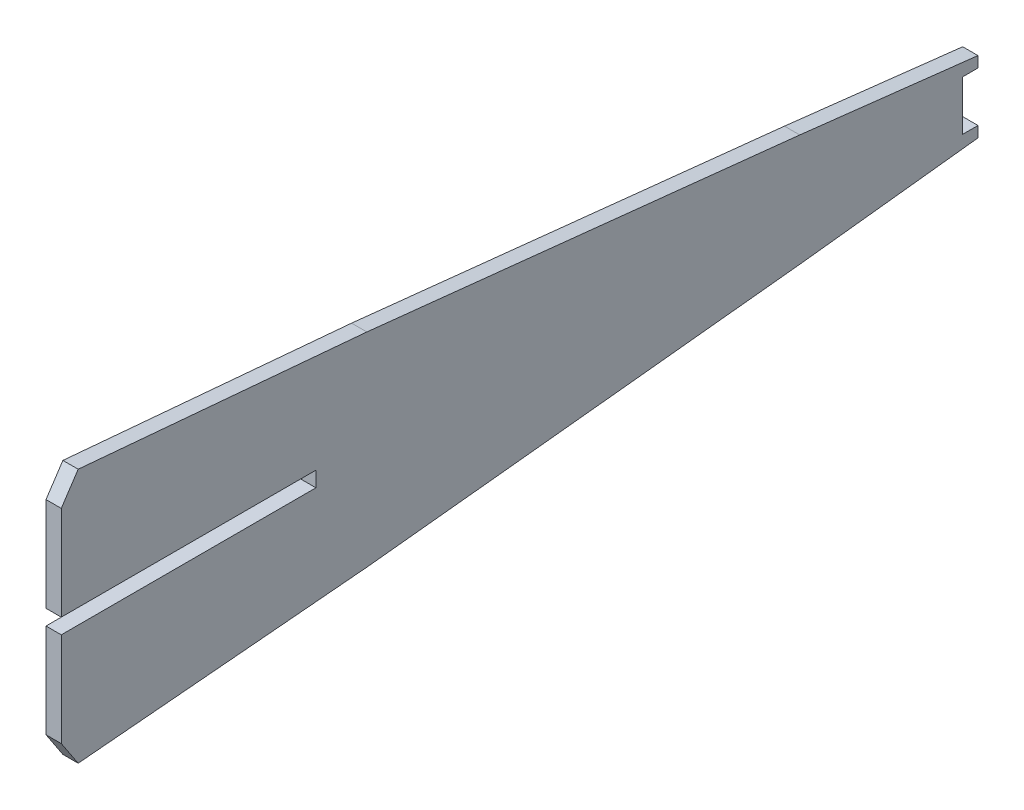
ISO-10303-21;
HEADER;
FILE_DESCRIPTION(('STEP AP214'),'2;1');
FILE_NAME('part.step','',(''),(''),'','','');
FILE_SCHEMA(('AUTOMOTIVE_DESIGN { 1 0 10303 214 1 1 1 1 }'));
ENDSEC;
DATA;
#1=APPLICATION_CONTEXT('core data for automotive mechanical design processes');
#2=APPLICATION_PROTOCOL_DEFINITION('international standard','automotive_design',2000,#1);
#3=PRODUCT_CONTEXT('',#1,'mechanical');
#4=PRODUCT('Part','Part','',(#3));
#5=PRODUCT_RELATED_PRODUCT_CATEGORY('part','',(#4));
#6=PRODUCT_DEFINITION_FORMATION('','',#4);
#7=PRODUCT_DEFINITION_CONTEXT('part definition',#1,'design');
#8=PRODUCT_DEFINITION('design','',#6,#7);
#9=PRODUCT_DEFINITION_SHAPE('','',#8);
#10=(LENGTH_UNIT() NAMED_UNIT(*) SI_UNIT(.MILLI.,.METRE.));
#11=(NAMED_UNIT(*) PLANE_ANGLE_UNIT() SI_UNIT($,.RADIAN.));
#12=(NAMED_UNIT(*) SI_UNIT($,.STERADIAN.) SOLID_ANGLE_UNIT());
#13=UNCERTAINTY_MEASURE_WITH_UNIT(LENGTH_MEASURE(1.E-05),#10,'distance_accuracy_value','');
#14=(GEOMETRIC_REPRESENTATION_CONTEXT(3) GLOBAL_UNCERTAINTY_ASSIGNED_CONTEXT((#13)) GLOBAL_UNIT_ASSIGNED_CONTEXT((#10,
#11,#12)) REPRESENTATION_CONTEXT('',''));
#15=CARTESIAN_POINT('',(0.,0.,0.));
#16=DIRECTION('',(0.,0.,1.));
#17=DIRECTION('',(1.,0.,0.));
#18=AXIS2_PLACEMENT_3D('',#15,#16,#17);
#19=CARTESIAN_POINT('',(3.,-20.,0.));
#20=DIRECTION('',(0.,0.,-1.));
#21=DIRECTION('',(-1.,0.,0.));
#22=AXIS2_PLACEMENT_3D('',#19,#20,#21);
#23=PLANE('',#22);
#24=DIRECTION('',(1.,0.,0.));
#25=VECTOR('',#24,1.);
#26=CARTESIAN_POINT('',(-7.,-1.5,0.));
#27=LINE('',#26,#25);
#28=CARTESIAN_POINT('',(0.,-1.5,0.));
#29=VERTEX_POINT('',#28);
#30=CARTESIAN_POINT('',(3.,-1.5,0.));
#31=VERTEX_POINT('',#30);
#32=EDGE_CURVE('E267',#29,#31,#27,.T.);
#33=ORIENTED_EDGE('',*,*,#32,.F.);
#34=DIRECTION('',(0.,-1.,0.));
#35=VECTOR('',#34,1.);
#36=CARTESIAN_POINT('',(0.,-20.,0.));
#37=LINE('',#36,#35);
#38=CARTESIAN_POINT('',(0.,-20.,0.));
#39=VERTEX_POINT('',#38);
#40=EDGE_CURVE('E202',#29,#39,#37,.T.);
#41=ORIENTED_EDGE('',*,*,#40,.T.);
#42=DIRECTION('',(-1.,0.,0.));
#43=VECTOR('',#42,1.);
#44=CARTESIAN_POINT('',(3.,-20.,0.));
#45=LINE('',#44,#43);
#46=CARTESIAN_POINT('',(3.,-20.,0.));
#47=VERTEX_POINT('',#46);
#48=EDGE_CURVE('E218',#47,#39,#45,.T.);
#49=ORIENTED_EDGE('',*,*,#48,.F.);
#50=DIRECTION('',(0.,-1.,0.));
#51=VECTOR('',#50,1.);
#52=CARTESIAN_POINT('',(3.,-20.,0.));
#53=LINE('',#52,#51);
#54=EDGE_CURVE('E274',#31,#47,#53,.T.);
#55=ORIENTED_EDGE('',*,*,#54,.F.);
#56=EDGE_LOOP('',(#33,#41,#49,#55));
#57=FACE_BOUND('',#56,.T.);
#58=ADVANCED_FACE('F39',(#57),#23,.F.);
#59=CARTESIAN_POINT('',(3.,0.,0.));
#60=DIRECTION('',(-1.,0.,0.));
#61=DIRECTION('',(0.,0.,1.));
#62=AXIS2_PLACEMENT_3D('',#59,#60,#61);
#63=PLANE('',#62);
#64=DIRECTION('',(0.,0.,-1.));
#65=VECTOR('',#64,1.);
#66=CARTESIAN_POINT('',(3.,-1.5,0.));
#67=LINE('',#66,#65);
#68=CARTESIAN_POINT('',(3.,-1.49999999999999,-50.));
#69=VERTEX_POINT('',#68);
#70=EDGE_CURVE('E304',#31,#69,#67,.T.);
#71=ORIENTED_EDGE('',*,*,#70,.F.);
#72=ORIENTED_EDGE('',*,*,#54,.T.);
#73=DIRECTION('',(0.,-0.833333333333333,-0.552770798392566));
#74=VECTOR('',#73,1.);
#75=CARTESIAN_POINT('',(3.,-20.,0.));
#76=LINE('',#75,#74);
#77=CARTESIAN_POINT('',(3.,-25.,-3.3166247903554));
#78=VERTEX_POINT('',#77);
#79=EDGE_CURVE('E163',#47,#78,#76,.T.);
#80=ORIENTED_EDGE('',*,*,#79,.T.);
#81=DIRECTION('',(0.,0.0878681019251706,-0.996132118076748));
#82=VECTOR('',#81,1.);
#83=CARTESIAN_POINT('',(3.,-25.,-3.3166247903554));
#84=LINE('',#83,#82);
#85=CARTESIAN_POINT('',(3.,-20.,-60.));
#86=VERTEX_POINT('',#85);
#87=EDGE_CURVE('E156',#78,#86,#84,.T.);
#88=ORIENTED_EDGE('',*,*,#87,.T.);
#89=DIRECTION('',(0.,0.105293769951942,-0.994441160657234));
#90=VECTOR('',#89,1.);
#91=CARTESIAN_POINT('',(3.,-20.,-60.));
#92=LINE('',#91,#90);
#93=CARTESIAN_POINT('',(3.,-11.,-145.));
#94=VERTEX_POINT('',#93);
#95=EDGE_CURVE('E161',#86,#94,#92,.T.);
#96=ORIENTED_EDGE('',*,*,#95,.T.);
#97=DIRECTION('',(0.,0.113546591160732,-0.993532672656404));
#98=VECTOR('',#97,1.);
#99=CARTESIAN_POINT('',(3.,-11.,-145.));
#100=LINE('',#99,#98);
#101=CARTESIAN_POINT('',(3.,-7.,-180.));
#102=VERTEX_POINT('',#101);
#103=EDGE_CURVE('E64',#94,#102,#100,.T.);
#104=ORIENTED_EDGE('',*,*,#103,.T.);
#105=DIRECTION('',(0.,1.,0.));
#106=VECTOR('',#105,1.);
#107=CARTESIAN_POINT('',(3.,-4.885,-180.));
#108=LINE('',#107,#106);
#109=CARTESIAN_POINT('',(3.,-4.885,-180.));
#110=VERTEX_POINT('',#109);
#111=EDGE_CURVE('E214',#102,#110,#108,.T.);
#112=ORIENTED_EDGE('',*,*,#111,.T.);
#113=DIRECTION('',(0.,0.,1.));
#114=VECTOR('',#113,1.);
#115=CARTESIAN_POINT('',(3.,-4.885,-180.));
#116=LINE('',#115,#114);
#117=CARTESIAN_POINT('',(3.,-4.885,-177.));
#118=VERTEX_POINT('',#117);
#119=EDGE_CURVE('E122',#110,#118,#116,.T.);
#120=ORIENTED_EDGE('',*,*,#119,.T.);
#121=DIRECTION('',(0.,1.,0.));
#122=VECTOR('',#121,1.);
#123=CARTESIAN_POINT('',(3.,4.885,-177.));
#124=LINE('',#123,#122);
#125=CARTESIAN_POINT('',(3.,4.885,-177.));
#126=VERTEX_POINT('',#125);
#127=EDGE_CURVE('E286',#118,#126,#124,.T.);
#128=ORIENTED_EDGE('',*,*,#127,.T.);
#129=DIRECTION('',(0.,0.,-1.));
#130=VECTOR('',#129,1.);
#131=CARTESIAN_POINT('',(3.,4.885,-180.));
#132=LINE('',#131,#130);
#133=CARTESIAN_POINT('',(3.,4.885,-180.));
#134=VERTEX_POINT('',#133);
#135=EDGE_CURVE('E287',#126,#134,#132,.T.);
#136=ORIENTED_EDGE('',*,*,#135,.T.);
#137=DIRECTION('',(0.,1.,0.));
#138=VECTOR('',#137,1.);
#139=CARTESIAN_POINT('',(3.,7.,-180.));
#140=LINE('',#139,#138);
#141=CARTESIAN_POINT('',(3.,7.,-180.));
#142=VERTEX_POINT('',#141);
#143=EDGE_CURVE('E289',#134,#142,#140,.T.);
#144=ORIENTED_EDGE('',*,*,#143,.T.);
#145=DIRECTION('',(0.,0.113546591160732,0.993532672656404));
#146=VECTOR('',#145,1.);
#147=CARTESIAN_POINT('',(3.,11.,-145.));
#148=LINE('',#147,#146);
#149=CARTESIAN_POINT('',(3.,11.,-145.));
#150=VERTEX_POINT('',#149);
#151=EDGE_CURVE('E295',#142,#150,#148,.T.);
#152=ORIENTED_EDGE('',*,*,#151,.T.);
#153=DIRECTION('',(0.,0.105293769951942,0.994441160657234));
#154=VECTOR('',#153,1.);
#155=CARTESIAN_POINT('',(3.,20.,-60.));
#156=LINE('',#155,#154);
#157=CARTESIAN_POINT('',(3.,20.,-60.));
#158=VERTEX_POINT('',#157);
#159=EDGE_CURVE('E294',#150,#158,#156,.T.);
#160=ORIENTED_EDGE('',*,*,#159,.T.);
#161=DIRECTION('',(0.,0.0878681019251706,0.996132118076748));
#162=VECTOR('',#161,1.);
#163=CARTESIAN_POINT('',(3.,25.,-3.3166247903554));
#164=LINE('',#163,#162);
#165=CARTESIAN_POINT('',(3.,25.,-3.3166247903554));
#166=VERTEX_POINT('',#165);
#167=EDGE_CURVE('E296',#158,#166,#164,.T.);
#168=ORIENTED_EDGE('',*,*,#167,.T.);
#169=DIRECTION('',(0.,-0.833333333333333,0.552770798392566));
#170=VECTOR('',#169,1.);
#171=CARTESIAN_POINT('',(3.,20.,0.));
#172=LINE('',#171,#170);
#173=CARTESIAN_POINT('',(3.,20.,0.));
#174=VERTEX_POINT('',#173);
#175=EDGE_CURVE('E299',#166,#174,#172,.T.);
#176=ORIENTED_EDGE('',*,*,#175,.T.);
#177=CARTESIAN_POINT('',(3.,1.5,0.));
#178=VERTEX_POINT('',#177);
#179=EDGE_CURVE('E300',#174,#178,#53,.T.);
#180=ORIENTED_EDGE('',*,*,#179,.T.);
#181=DIRECTION('',(0.,0.,1.));
#182=VECTOR('',#181,1.);
#183=CARTESIAN_POINT('',(3.,1.5,0.));
#184=LINE('',#183,#182);
#185=CARTESIAN_POINT('',(3.,1.5,-50.));
#186=VERTEX_POINT('',#185);
#187=EDGE_CURVE('E277',#186,#178,#184,.T.);
#188=ORIENTED_EDGE('',*,*,#187,.F.);
#189=DIRECTION('',(0.,1.,0.));
#190=VECTOR('',#189,1.);
#191=CARTESIAN_POINT('',(3.,-1.49999999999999,-50.));
#192=LINE('',#191,#190);
#193=EDGE_CURVE('E278',#69,#186,#192,.T.);
#194=ORIENTED_EDGE('',*,*,#193,.F.);
#195=EDGE_LOOP('',(#71,#72,#80,#88,#96,#104,#112,#120,#128,#136,#144,#152,#160,#168,#176,#180,
#188,#194));
#196=FACE_BOUND('',#195,.T.);
#197=ADVANCED_FACE('F157',(#196),#63,.F.);
#198=CARTESIAN_POINT('',(3.,-4.885,-180.));
#199=DIRECTION('',(0.,0.,1.));
#200=DIRECTION('',(1.,0.,0.));
#201=AXIS2_PLACEMENT_3D('',#198,#199,#200);
#202=PLANE('',#201);
#203=DIRECTION('',(0.,1.,0.));
#204=VECTOR('',#203,1.);
#205=CARTESIAN_POINT('',(0.,-4.885,-180.));
#206=LINE('',#205,#204);
#207=CARTESIAN_POINT('',(0.,-7.,-180.));
#208=VERTEX_POINT('',#207);
#209=CARTESIAN_POINT('',(0.,-4.885,-180.));
#210=VERTEX_POINT('',#209);
#211=EDGE_CURVE('E183',#208,#210,#206,.T.);
#212=ORIENTED_EDGE('',*,*,#211,.T.);
#213=DIRECTION('',(-1.,0.,0.));
#214=VECTOR('',#213,1.);
#215=CARTESIAN_POINT('',(3.,-4.885,-180.));
#216=LINE('',#215,#214);
#217=EDGE_CURVE('E246',#110,#210,#216,.T.);
#218=ORIENTED_EDGE('',*,*,#217,.F.);
#219=ORIENTED_EDGE('',*,*,#111,.F.);
#220=DIRECTION('',(-1.,0.,0.));
#221=VECTOR('',#220,1.);
#222=CARTESIAN_POINT('',(3.,-7.,-180.));
#223=LINE('',#222,#221);
#224=EDGE_CURVE('E182',#102,#208,#223,.T.);
#225=ORIENTED_EDGE('',*,*,#224,.T.);
#226=EDGE_LOOP('',(#212,#218,#219,#225));
#227=FACE_BOUND('',#226,.T.);
#228=ADVANCED_FACE('F41',(#227),#202,.F.);
#229=CARTESIAN_POINT('',(3.,-4.885,-180.));
#230=DIRECTION('',(0.,-1.,0.));
#231=DIRECTION('',(0.,0.,-1.));
#232=AXIS2_PLACEMENT_3D('',#229,#230,#231);
#233=PLANE('',#232);
#234=DIRECTION('',(0.,0.,1.));
#235=VECTOR('',#234,1.);
#236=CARTESIAN_POINT('',(0.,-4.885,-180.));
#237=LINE('',#236,#235);
#238=CARTESIAN_POINT('',(0.,-4.885,-177.));
#239=VERTEX_POINT('',#238);
#240=EDGE_CURVE('E189',#210,#239,#237,.T.);
#241=ORIENTED_EDGE('',*,*,#240,.T.);
#242=DIRECTION('',(-1.,0.,0.));
#243=VECTOR('',#242,1.);
#244=CARTESIAN_POINT('',(3.,-4.885,-177.));
#245=LINE('',#244,#243);
#246=EDGE_CURVE('E244',#118,#239,#245,.T.);
#247=ORIENTED_EDGE('',*,*,#246,.F.);
#248=ORIENTED_EDGE('',*,*,#119,.F.);
#249=ORIENTED_EDGE('',*,*,#217,.T.);
#250=EDGE_LOOP('',(#241,#247,#248,#249));
#251=FACE_BOUND('',#250,.T.);
#252=ADVANCED_FACE('F312',(#251),#233,.F.);
#253=CARTESIAN_POINT('',(3.,4.885,-177.));
#254=DIRECTION('',(0.,0.,1.));
#255=DIRECTION('',(1.,0.,0.));
#256=AXIS2_PLACEMENT_3D('',#253,#254,#255);
#257=PLANE('',#256);
#258=DIRECTION('',(0.,1.,0.));
#259=VECTOR('',#258,1.);
#260=CARTESIAN_POINT('',(0.,4.885,-177.));
#261=LINE('',#260,#259);
#262=CARTESIAN_POINT('',(0.,4.885,-177.));
#263=VERTEX_POINT('',#262);
#264=EDGE_CURVE('E191',#239,#263,#261,.T.);
#265=ORIENTED_EDGE('',*,*,#264,.T.);
#266=DIRECTION('',(-1.,0.,0.));
#267=VECTOR('',#266,1.);
#268=CARTESIAN_POINT('',(3.,4.885,-177.));
#269=LINE('',#268,#267);
#270=EDGE_CURVE('E238',#126,#263,#269,.T.);
#271=ORIENTED_EDGE('',*,*,#270,.F.);
#272=ORIENTED_EDGE('',*,*,#127,.F.);
#273=ORIENTED_EDGE('',*,*,#246,.T.);
#274=EDGE_LOOP('',(#265,#271,#272,#273));
#275=FACE_BOUND('',#274,.T.);
#276=ADVANCED_FACE('F318',(#275),#257,.F.);
#277=CARTESIAN_POINT('',(3.,4.885,-180.));
#278=DIRECTION('',(0.,1.,0.));
#279=DIRECTION('',(0.,0.,1.));
#280=AXIS2_PLACEMENT_3D('',#277,#278,#279);
#281=PLANE('',#280);
#282=DIRECTION('',(0.,0.,-1.));
#283=VECTOR('',#282,1.);
#284=CARTESIAN_POINT('',(0.,4.885,-180.));
#285=LINE('',#284,#283);
#286=CARTESIAN_POINT('',(0.,4.885,-180.));
#287=VERTEX_POINT('',#286);
#288=EDGE_CURVE('E192',#263,#287,#285,.T.);
#289=ORIENTED_EDGE('',*,*,#288,.T.);
#290=DIRECTION('',(-1.,0.,0.));
#291=VECTOR('',#290,1.);
#292=CARTESIAN_POINT('',(3.,4.885,-180.));
#293=LINE('',#292,#291);
#294=EDGE_CURVE('E240',#134,#287,#293,.T.);
#295=ORIENTED_EDGE('',*,*,#294,.F.);
#296=ORIENTED_EDGE('',*,*,#135,.F.);
#297=ORIENTED_EDGE('',*,*,#270,.T.);
#298=EDGE_LOOP('',(#289,#295,#296,#297));
#299=FACE_BOUND('',#298,.T.);
#300=ADVANCED_FACE('F323',(#299),#281,.F.);
#301=CARTESIAN_POINT('',(3.,7.,-180.));
#302=DIRECTION('',(0.,0.,1.));
#303=DIRECTION('',(1.,0.,0.));
#304=AXIS2_PLACEMENT_3D('',#301,#302,#303);
#305=PLANE('',#304);
#306=DIRECTION('',(0.,1.,0.));
#307=VECTOR('',#306,1.);
#308=CARTESIAN_POINT('',(0.,7.,-180.));
#309=LINE('',#308,#307);
#310=CARTESIAN_POINT('',(0.,7.,-180.));
#311=VERTEX_POINT('',#310);
#312=EDGE_CURVE('E194',#287,#311,#309,.T.);
#313=ORIENTED_EDGE('',*,*,#312,.T.);
#314=DIRECTION('',(-1.,0.,0.));
#315=VECTOR('',#314,1.);
#316=CARTESIAN_POINT('',(3.,7.,-180.));
#317=LINE('',#316,#315);
#318=EDGE_CURVE('E233',#142,#311,#317,.T.);
#319=ORIENTED_EDGE('',*,*,#318,.F.);
#320=ORIENTED_EDGE('',*,*,#143,.F.);
#321=ORIENTED_EDGE('',*,*,#294,.T.);
#322=EDGE_LOOP('',(#313,#319,#320,#321));
#323=FACE_BOUND('',#322,.T.);
#324=ADVANCED_FACE('F328',(#323),#305,.F.);
#325=CARTESIAN_POINT('',(3.,11.,-145.));
#326=DIRECTION('',(0.,-0.993532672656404,0.113546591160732));
#327=DIRECTION('',(0.,-0.113546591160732,-0.993532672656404));
#328=AXIS2_PLACEMENT_3D('',#325,#326,#327);
#329=PLANE('',#328);
#330=DIRECTION('',(0.,0.113546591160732,0.993532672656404));
#331=VECTOR('',#330,1.);
#332=CARTESIAN_POINT('',(0.,11.,-145.));
#333=LINE('',#332,#331);
#334=CARTESIAN_POINT('',(0.,11.,-145.));
#335=VERTEX_POINT('',#334);
#336=EDGE_CURVE('E197',#311,#335,#333,.T.);
#337=ORIENTED_EDGE('',*,*,#336,.T.);
#338=DIRECTION('',(-1.,0.,0.));
#339=VECTOR('',#338,1.);
#340=CARTESIAN_POINT('',(3.,11.,-145.));
#341=LINE('',#340,#339);
#342=EDGE_CURVE('E231',#150,#335,#341,.T.);
#343=ORIENTED_EDGE('',*,*,#342,.F.);
#344=ORIENTED_EDGE('',*,*,#151,.F.);
#345=ORIENTED_EDGE('',*,*,#318,.T.);
#346=EDGE_LOOP('',(#337,#343,#344,#345));
#347=FACE_BOUND('',#346,.T.);
#348=ADVANCED_FACE('F334',(#347),#329,.F.);
#349=CARTESIAN_POINT('',(3.,20.,-60.));
#350=DIRECTION('',(0.,-0.994441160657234,0.105293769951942));
#351=DIRECTION('',(0.,-0.105293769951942,-0.994441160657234));
#352=AXIS2_PLACEMENT_3D('',#349,#350,#351);
#353=PLANE('',#352);
#354=DIRECTION('',(0.,0.105293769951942,0.994441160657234));
#355=VECTOR('',#354,1.);
#356=CARTESIAN_POINT('',(0.,20.,-60.));
#357=LINE('',#356,#355);
#358=CARTESIAN_POINT('',(0.,20.,-60.));
#359=VERTEX_POINT('',#358);
#360=EDGE_CURVE('E200',#335,#359,#357,.T.);
#361=ORIENTED_EDGE('',*,*,#360,.T.);
#362=DIRECTION('',(-1.,0.,0.));
#363=VECTOR('',#362,1.);
#364=CARTESIAN_POINT('',(3.,20.,-60.));
#365=LINE('',#364,#363);
#366=EDGE_CURVE('E229',#158,#359,#365,.T.);
#367=ORIENTED_EDGE('',*,*,#366,.F.);
#368=ORIENTED_EDGE('',*,*,#159,.F.);
#369=ORIENTED_EDGE('',*,*,#342,.T.);
#370=EDGE_LOOP('',(#361,#367,#368,#369));
#371=FACE_BOUND('',#370,.T.);
#372=ADVANCED_FACE('F339',(#371),#353,.F.);
#373=CARTESIAN_POINT('',(3.,25.,-3.3166247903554));
#374=DIRECTION('',(0.,-0.996132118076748,0.0878681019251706));
#375=DIRECTION('',(0.,-0.0878681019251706,-0.996132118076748));
#376=AXIS2_PLACEMENT_3D('',#373,#374,#375);
#377=PLANE('',#376);
#378=DIRECTION('',(0.,0.0878681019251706,0.996132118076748));
#379=VECTOR('',#378,1.);
#380=CARTESIAN_POINT('',(0.,25.,-3.3166247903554));
#381=LINE('',#380,#379);
#382=CARTESIAN_POINT('',(0.,25.,-3.3166247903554));
#383=VERTEX_POINT('',#382);
#384=EDGE_CURVE('E203',#359,#383,#381,.T.);
#385=ORIENTED_EDGE('',*,*,#384,.T.);
#386=DIRECTION('',(-1.,0.,0.));
#387=VECTOR('',#386,1.);
#388=CARTESIAN_POINT('',(3.,25.,-3.3166247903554));
#389=LINE('',#388,#387);
#390=EDGE_CURVE('E223',#166,#383,#389,.T.);
#391=ORIENTED_EDGE('',*,*,#390,.F.);
#392=ORIENTED_EDGE('',*,*,#167,.F.);
#393=ORIENTED_EDGE('',*,*,#366,.T.);
#394=EDGE_LOOP('',(#385,#391,#392,#393));
#395=FACE_BOUND('',#394,.T.);
#396=ADVANCED_FACE('F343',(#395),#377,.F.);
#397=CARTESIAN_POINT('',(3.,20.,0.));
#398=DIRECTION('',(0.,-0.552770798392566,-0.833333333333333));
#399=DIRECTION('',(0.,0.833333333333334,-0.552770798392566));
#400=AXIS2_PLACEMENT_3D('',#397,#398,#399);
#401=PLANE('',#400);
#402=DIRECTION('',(0.,-0.833333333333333,0.552770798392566));
#403=VECTOR('',#402,1.);
#404=CARTESIAN_POINT('',(0.,20.,0.));
#405=LINE('',#404,#403);
#406=CARTESIAN_POINT('',(0.,20.,0.));
#407=VERTEX_POINT('',#406);
#408=EDGE_CURVE('E201',#383,#407,#405,.T.);
#409=ORIENTED_EDGE('',*,*,#408,.T.);
#410=DIRECTION('',(-1.,0.,0.));
#411=VECTOR('',#410,1.);
#412=CARTESIAN_POINT('',(3.,20.,0.));
#413=LINE('',#412,#411);
#414=EDGE_CURVE('E225',#174,#407,#413,.T.);
#415=ORIENTED_EDGE('',*,*,#414,.F.);
#416=ORIENTED_EDGE('',*,*,#175,.F.);
#417=ORIENTED_EDGE('',*,*,#390,.T.);
#418=EDGE_LOOP('',(#409,#415,#416,#417));
#419=FACE_BOUND('',#418,.T.);
#420=ADVANCED_FACE('F346',(#419),#401,.F.);
#421=CARTESIAN_POINT('',(0.,1.5,0.));
#422=VERTEX_POINT('',#421);
#423=EDGE_CURVE('E206',#407,#422,#37,.T.);
#424=ORIENTED_EDGE('',*,*,#423,.T.);
#425=DIRECTION('',(1.,0.,0.));
#426=VECTOR('',#425,1.);
#427=CARTESIAN_POINT('',(-7.,1.5,0.));
#428=LINE('',#427,#426);
#429=EDGE_CURVE('E188',#422,#178,#428,.T.);
#430=ORIENTED_EDGE('',*,*,#429,.T.);
#431=ORIENTED_EDGE('',*,*,#179,.F.);
#432=ORIENTED_EDGE('',*,*,#414,.T.);
#433=EDGE_LOOP('',(#424,#430,#431,#432));
#434=FACE_BOUND('',#433,.T.);
#435=ADVANCED_FACE('F352',(#434),#23,.F.);
#436=CARTESIAN_POINT('',(3.,-20.,0.));
#437=DIRECTION('',(0.,0.552770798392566,-0.833333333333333));
#438=DIRECTION('',(0.,0.833333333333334,0.552770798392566));
#439=AXIS2_PLACEMENT_3D('',#436,#437,#438);
#440=PLANE('',#439);
#441=DIRECTION('',(0.,-0.833333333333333,-0.552770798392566));
#442=VECTOR('',#441,1.);
#443=CARTESIAN_POINT('',(0.,-20.,0.));
#444=LINE('',#443,#442);
#445=CARTESIAN_POINT('',(0.,-25.,-3.3166247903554));
#446=VERTEX_POINT('',#445);
#447=EDGE_CURVE('E207',#39,#446,#444,.T.);
#448=ORIENTED_EDGE('',*,*,#447,.T.);
#449=DIRECTION('',(-1.,0.,0.));
#450=VECTOR('',#449,1.);
#451=CARTESIAN_POINT('',(3.,-25.,-3.3166247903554));
#452=LINE('',#451,#450);
#453=EDGE_CURVE('E176',#78,#446,#452,.T.);
#454=ORIENTED_EDGE('',*,*,#453,.F.);
#455=ORIENTED_EDGE('',*,*,#79,.F.);
#456=ORIENTED_EDGE('',*,*,#48,.T.);
#457=EDGE_LOOP('',(#448,#454,#455,#456));
#458=FACE_BOUND('',#457,.T.);
#459=ADVANCED_FACE('F307',(#458),#440,.F.);
#460=CARTESIAN_POINT('',(3.,-25.,-3.3166247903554));
#461=DIRECTION('',(0.,0.996132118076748,0.0878681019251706));
#462=DIRECTION('',(0.,-0.0878681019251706,0.996132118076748));
#463=AXIS2_PLACEMENT_3D('',#460,#461,#462);
#464=PLANE('',#463);
#465=DIRECTION('',(0.,0.0878681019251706,-0.996132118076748));
#466=VECTOR('',#465,1.);
#467=CARTESIAN_POINT('',(0.,-25.,-3.3166247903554));
#468=LINE('',#467,#466);
#469=CARTESIAN_POINT('',(0.,-20.,-60.));
#470=VERTEX_POINT('',#469);
#471=EDGE_CURVE('E174',#446,#470,#468,.T.);
#472=ORIENTED_EDGE('',*,*,#471,.T.);
#473=DIRECTION('',(-1.,0.,0.));
#474=VECTOR('',#473,1.);
#475=CARTESIAN_POINT('',(3.,-20.,-60.));
#476=LINE('',#475,#474);
#477=EDGE_CURVE('E168',#86,#470,#476,.T.);
#478=ORIENTED_EDGE('',*,*,#477,.F.);
#479=ORIENTED_EDGE('',*,*,#87,.F.);
#480=ORIENTED_EDGE('',*,*,#453,.T.);
#481=EDGE_LOOP('',(#472,#478,#479,#480));
#482=FACE_BOUND('',#481,.T.);
#483=ADVANCED_FACE('F171',(#482),#464,.F.);
#484=CARTESIAN_POINT('',(3.,-20.,-60.));
#485=DIRECTION('',(0.,0.994441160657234,0.105293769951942));
#486=DIRECTION('',(0.,-0.105293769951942,0.994441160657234));
#487=AXIS2_PLACEMENT_3D('',#484,#485,#486);
#488=PLANE('',#487);
#489=DIRECTION('',(0.,0.105293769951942,-0.994441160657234));
#490=VECTOR('',#489,1.);
#491=CARTESIAN_POINT('',(0.,-20.,-60.));
#492=LINE('',#491,#490);
#493=CARTESIAN_POINT('',(0.,-11.,-145.));
#494=VERTEX_POINT('',#493);
#495=EDGE_CURVE('E215',#470,#494,#492,.T.);
#496=ORIENTED_EDGE('',*,*,#495,.T.);
#497=DIRECTION('',(-1.,0.,0.));
#498=VECTOR('',#497,1.);
#499=CARTESIAN_POINT('',(3.,-11.,-145.));
#500=LINE('',#499,#498);
#501=EDGE_CURVE('E180',#94,#494,#500,.T.);
#502=ORIENTED_EDGE('',*,*,#501,.F.);
#503=ORIENTED_EDGE('',*,*,#95,.F.);
#504=ORIENTED_EDGE('',*,*,#477,.T.);
#505=EDGE_LOOP('',(#496,#502,#503,#504));
#506=FACE_BOUND('',#505,.T.);
#507=ADVANCED_FACE('F178',(#506),#488,.F.);
#508=CARTESIAN_POINT('',(3.,-11.,-145.));
#509=DIRECTION('',(0.,0.993532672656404,0.113546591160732));
#510=DIRECTION('',(0.,-0.113546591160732,0.993532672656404));
#511=AXIS2_PLACEMENT_3D('',#508,#509,#510);
#512=PLANE('',#511);
#513=DIRECTION('',(0.,0.113546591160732,-0.993532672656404));
#514=VECTOR('',#513,1.);
#515=CARTESIAN_POINT('',(0.,-11.,-145.));
#516=LINE('',#515,#514);
#517=EDGE_CURVE('E111',#494,#208,#516,.T.);
#518=ORIENTED_EDGE('',*,*,#517,.T.);
#519=ORIENTED_EDGE('',*,*,#224,.F.);
#520=ORIENTED_EDGE('',*,*,#103,.F.);
#521=ORIENTED_EDGE('',*,*,#501,.T.);
#522=EDGE_LOOP('',(#518,#519,#520,#521));
#523=FACE_BOUND('',#522,.T.);
#524=ADVANCED_FACE('F310',(#523),#512,.F.);
#525=CARTESIAN_POINT('',(0.,0.,0.));
#526=DIRECTION('',(-1.,0.,0.));
#527=DIRECTION('',(0.,0.,1.));
#528=AXIS2_PLACEMENT_3D('',#525,#526,#527);
#529=PLANE('',#528);
#530=DIRECTION('',(0.,0.,-1.));
#531=VECTOR('',#530,1.);
#532=CARTESIAN_POINT('',(0.,1.5,0.));
#533=LINE('',#532,#531);
#534=CARTESIAN_POINT('',(0.,1.5,-50.));
#535=VERTEX_POINT('',#534);
#536=EDGE_CURVE('E11',#422,#535,#533,.T.);
#537=ORIENTED_EDGE('',*,*,#536,.F.);
#538=ORIENTED_EDGE('',*,*,#423,.F.);
#539=ORIENTED_EDGE('',*,*,#408,.F.);
#540=ORIENTED_EDGE('',*,*,#384,.F.);
#541=ORIENTED_EDGE('',*,*,#360,.F.);
#542=ORIENTED_EDGE('',*,*,#336,.F.);
#543=ORIENTED_EDGE('',*,*,#312,.F.);
#544=ORIENTED_EDGE('',*,*,#288,.F.);
#545=ORIENTED_EDGE('',*,*,#264,.F.);
#546=ORIENTED_EDGE('',*,*,#240,.F.);
#547=ORIENTED_EDGE('',*,*,#211,.F.);
#548=ORIENTED_EDGE('',*,*,#517,.F.);
#549=ORIENTED_EDGE('',*,*,#495,.F.);
#550=ORIENTED_EDGE('',*,*,#471,.F.);
#551=ORIENTED_EDGE('',*,*,#447,.F.);
#552=ORIENTED_EDGE('',*,*,#40,.F.);
#553=DIRECTION('',(0.,0.,1.));
#554=VECTOR('',#553,1.);
#555=CARTESIAN_POINT('',(0.,-1.5,0.));
#556=LINE('',#555,#554);
#557=CARTESIAN_POINT('',(0.,-1.49999999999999,-50.));
#558=VERTEX_POINT('',#557);
#559=EDGE_CURVE('E247',#558,#29,#556,.T.);
#560=ORIENTED_EDGE('',*,*,#559,.F.);
#561=DIRECTION('',(0.,-1.,0.));
#562=VECTOR('',#561,1.);
#563=CARTESIAN_POINT('',(0.,0.,-50.));
#564=LINE('',#563,#562);
#565=EDGE_CURVE('E50',#535,#558,#564,.T.);
#566=ORIENTED_EDGE('',*,*,#565,.F.);
#567=EDGE_LOOP('',(#537,#538,#539,#540,#541,#542,#543,#544,#545,#546,#547,#548,#549,#550,#551,
#552,#560,#566));
#568=FACE_BOUND('',#567,.T.);
#569=ADVANCED_FACE('F265',(#568),#529,.T.);
#570=CARTESIAN_POINT('',(-7.,1.5,0.));
#571=DIRECTION('',(0.,1.,0.));
#572=DIRECTION('',(0.,0.,1.));
#573=AXIS2_PLACEMENT_3D('',#570,#571,#572);
#574=PLANE('',#573);
#575=ORIENTED_EDGE('',*,*,#536,.T.);
#576=DIRECTION('',(1.,0.,0.));
#577=VECTOR('',#576,1.);
#578=CARTESIAN_POINT('',(-7.,1.5,-50.));
#579=LINE('',#578,#577);
#580=EDGE_CURVE('E256',#535,#186,#579,.T.);
#581=ORIENTED_EDGE('',*,*,#580,.T.);
#582=ORIENTED_EDGE('',*,*,#187,.T.);
#583=ORIENTED_EDGE('',*,*,#429,.F.);
#584=EDGE_LOOP('',(#575,#581,#582,#583));
#585=FACE_BOUND('',#584,.T.);
#586=ADVANCED_FACE('F361',(#585),#574,.F.);
#587=CARTESIAN_POINT('',(-7.,-1.49999999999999,-50.));
#588=DIRECTION('',(0.,0.,-1.));
#589=DIRECTION('',(-1.,0.,0.));
#590=AXIS2_PLACEMENT_3D('',#587,#588,#589);
#591=PLANE('',#590);
#592=ORIENTED_EDGE('',*,*,#565,.T.);
#593=DIRECTION('',(1.,0.,0.));
#594=VECTOR('',#593,1.);
#595=CARTESIAN_POINT('',(-7.,-1.49999999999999,-50.));
#596=LINE('',#595,#594);
#597=EDGE_CURVE('E53',#558,#69,#596,.T.);
#598=ORIENTED_EDGE('',*,*,#597,.T.);
#599=ORIENTED_EDGE('',*,*,#193,.T.);
#600=ORIENTED_EDGE('',*,*,#580,.F.);
#601=EDGE_LOOP('',(#592,#598,#599,#600));
#602=FACE_BOUND('',#601,.T.);
#603=ADVANCED_FACE('F251',(#602),#591,.F.);
#604=CARTESIAN_POINT('',(-7.,-1.5,0.));
#605=DIRECTION('',(0.,-1.,0.));
#606=DIRECTION('',(0.,0.,-1.));
#607=AXIS2_PLACEMENT_3D('',#604,#605,#606);
#608=PLANE('',#607);
#609=ORIENTED_EDGE('',*,*,#559,.T.);
#610=ORIENTED_EDGE('',*,*,#32,.T.);
#611=ORIENTED_EDGE('',*,*,#70,.T.);
#612=ORIENTED_EDGE('',*,*,#597,.F.);
#613=EDGE_LOOP('',(#609,#610,#611,#612));
#614=FACE_BOUND('',#613,.T.);
#615=ADVANCED_FACE('F270',(#614),#608,.F.);
#616=CLOSED_SHELL('',(#58,#197,#228,#252,#276,#300,#324,#348,#372,#396,#420,#435,#459,#483,#507,
#524,#569,#586,#603,#615));
#617=MANIFOLD_SOLID_BREP('B2',#616);
#618=ADVANCED_BREP_SHAPE_REPRESENTATION('',(#18,#617),#14);
#619=SHAPE_DEFINITION_REPRESENTATION(#9,#618);
ENDSEC;
END-ISO-10303-21;
